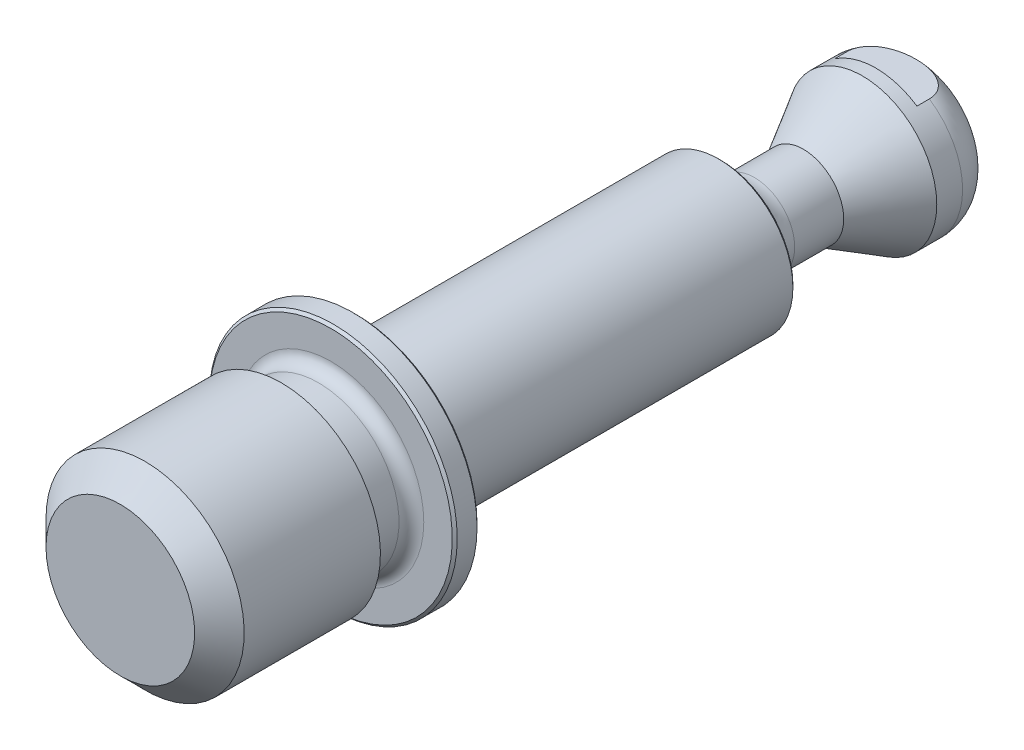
ISO-10303-21;
HEADER;
FILE_DESCRIPTION(('STEP AP214'),'2;1');
FILE_NAME('part.step','',(''),(''),'','','');
FILE_SCHEMA(('AUTOMOTIVE_DESIGN { 1 0 10303 214 1 1 1 1 }'));
ENDSEC;
DATA;
#1=APPLICATION_CONTEXT('core data for automotive mechanical design processes');
#2=APPLICATION_PROTOCOL_DEFINITION('international standard','automotive_design',2000,#1);
#3=PRODUCT_CONTEXT('',#1,'mechanical');
#4=PRODUCT('Part','Part','',(#3));
#5=PRODUCT_RELATED_PRODUCT_CATEGORY('part','',(#4));
#6=PRODUCT_DEFINITION_FORMATION('','',#4);
#7=PRODUCT_DEFINITION_CONTEXT('part definition',#1,'design');
#8=PRODUCT_DEFINITION('design','',#6,#7);
#9=PRODUCT_DEFINITION_SHAPE('','',#8);
#10=(LENGTH_UNIT() NAMED_UNIT(*) SI_UNIT(.MILLI.,.METRE.));
#11=(NAMED_UNIT(*) PLANE_ANGLE_UNIT() SI_UNIT($,.RADIAN.));
#12=(NAMED_UNIT(*) SI_UNIT($,.STERADIAN.) SOLID_ANGLE_UNIT());
#13=UNCERTAINTY_MEASURE_WITH_UNIT(LENGTH_MEASURE(1.E-05),#10,'distance_accuracy_value','');
#14=(GEOMETRIC_REPRESENTATION_CONTEXT(3) GLOBAL_UNCERTAINTY_ASSIGNED_CONTEXT((#13)) GLOBAL_UNIT_ASSIGNED_CONTEXT((#10,
#11,#12)) REPRESENTATION_CONTEXT('',''));
#15=CARTESIAN_POINT('',(0.,0.,0.));
#16=DIRECTION('',(0.,0.,1.));
#17=DIRECTION('',(1.,0.,0.));
#18=AXIS2_PLACEMENT_3D('',#15,#16,#17);
#19=CARTESIAN_POINT('',(0.,0.,0.));
#20=DIRECTION('',(0.,0.,1.));
#21=DIRECTION('',(-1.,0.,0.));
#22=AXIS2_PLACEMENT_3D('',#19,#20,#21);
#23=PLANE('',#22);
#24=CARTESIAN_POINT('',(0.,0.,0.));
#25=DIRECTION('',(0.,0.,1.));
#26=DIRECTION('',(-1.,0.,0.));
#27=AXIS2_PLACEMENT_3D('',#24,#25,#26);
#28=CIRCLE('',#27,9.8);
#29=CARTESIAN_POINT('',(-9.8,0.,0.));
#30=VERTEX_POINT('',#29);
#31=EDGE_CURVE('E157',#30,#30,#28,.T.);
#32=ORIENTED_EDGE('',*,*,#31,.T.);
#33=EDGE_LOOP('',(#32));
#34=FACE_BOUND('',#33,.T.);
#35=CARTESIAN_POINT('',(0.,0.,0.));
#36=DIRECTION('',(0.,0.,1.));
#37=DIRECTION('',(-1.,0.,0.));
#38=AXIS2_PLACEMENT_3D('',#35,#36,#37);
#39=CIRCLE('',#38,7.5);
#40=CARTESIAN_POINT('',(-7.5,0.,0.));
#41=VERTEX_POINT('',#40);
#42=EDGE_CURVE('E137',#41,#41,#39,.F.);
#43=ORIENTED_EDGE('',*,*,#42,.T.);
#44=EDGE_LOOP('',(#43));
#45=FACE_BOUND('',#44,.T.);
#46=ADVANCED_FACE('F15',(#34,#45),#23,.T.);
#47=CARTESIAN_POINT('',(0.,0.,0.));
#48=DIRECTION('',(0.,0.,-1.));
#49=DIRECTION('',(1.,0.,0.));
#50=AXIS2_PLACEMENT_3D('',#47,#48,#49);
#51=CYLINDRICAL_SURFACE('',#50,10.);
#52=CARTESIAN_POINT('',(0.,0.,-0.199999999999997));
#53=DIRECTION('',(0.,0.,1.));
#54=DIRECTION('',(-1.,0.,0.));
#55=AXIS2_PLACEMENT_3D('',#52,#53,#54);
#56=CIRCLE('',#55,10.);
#57=CARTESIAN_POINT('',(-10.,0.,-0.199999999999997));
#58=VERTEX_POINT('',#57);
#59=EDGE_CURVE('E153',#58,#58,#56,.F.);
#60=ORIENTED_EDGE('',*,*,#59,.T.);
#61=EDGE_LOOP('',(#60));
#62=FACE_BOUND('',#61,.T.);
#63=CARTESIAN_POINT('',(0.,0.,-1.8));
#64=DIRECTION('',(0.,0.,-1.));
#65=DIRECTION('',(1.,0.,0.));
#66=AXIS2_PLACEMENT_3D('',#63,#64,#65);
#67=CIRCLE('',#66,10.);
#68=CARTESIAN_POINT('',(10.,0.,-1.8));
#69=VERTEX_POINT('',#68);
#70=EDGE_CURVE('E149',#69,#69,#67,.F.);
#71=ORIENTED_EDGE('',*,*,#70,.T.);
#72=EDGE_LOOP('',(#71));
#73=FACE_BOUND('',#72,.T.);
#74=ADVANCED_FACE('F225',(#62,#73),#51,.T.);
#75=CARTESIAN_POINT('',(10.,0.,-2.));
#76=DIRECTION('',(0.,0.,-1.));
#77=DIRECTION('',(1.,0.,0.));
#78=AXIS2_PLACEMENT_3D('',#75,#76,#77);
#79=PLANE('',#78);
#80=CARTESIAN_POINT('',(0.,0.,-2.));
#81=DIRECTION('',(0.,0.,-1.));
#82=DIRECTION('',(1.,0.,0.));
#83=AXIS2_PLACEMENT_3D('',#80,#81,#82);
#84=CIRCLE('',#83,9.8);
#85=CARTESIAN_POINT('',(9.8,0.,-2.));
#86=VERTEX_POINT('',#85);
#87=EDGE_CURVE('E161',#86,#86,#84,.T.);
#88=ORIENTED_EDGE('',*,*,#87,.T.);
#89=EDGE_LOOP('',(#88));
#90=FACE_BOUND('',#89,.T.);
#91=CARTESIAN_POINT('',(0.,0.,-2.));
#92=DIRECTION('',(0.,0.,-1.));
#93=DIRECTION('',(1.,0.,0.));
#94=AXIS2_PLACEMENT_3D('',#91,#92,#93);
#95=CIRCLE('',#94,6.4);
#96=CARTESIAN_POINT('',(6.4,0.,-2.));
#97=VERTEX_POINT('',#96);
#98=EDGE_CURVE('E145',#97,#97,#95,.F.);
#99=ORIENTED_EDGE('',*,*,#98,.T.);
#100=EDGE_LOOP('',(#99));
#101=FACE_BOUND('',#100,.T.);
#102=ADVANCED_FACE('F221',(#90,#101),#79,.T.);
#103=CARTESIAN_POINT('',(0.,0.,0.));
#104=DIRECTION('',(0.,0.,-1.));
#105=DIRECTION('',(1.,0.,0.));
#106=AXIS2_PLACEMENT_3D('',#103,#104,#105);
#107=CYLINDRICAL_SURFACE('',#106,6.);
#108=CARTESIAN_POINT('',(0.,0.,-2.4));
#109=DIRECTION('',(0.,0.,-1.));
#110=DIRECTION('',(1.,0.,0.));
#111=AXIS2_PLACEMENT_3D('',#108,#109,#110);
#112=CIRCLE('',#111,6.);
#113=CARTESIAN_POINT('',(6.,0.,-2.4));
#114=VERTEX_POINT('',#113);
#115=EDGE_CURVE('E141',#114,#114,#112,.T.);
#116=ORIENTED_EDGE('',*,*,#115,.T.);
#117=EDGE_LOOP('',(#116));
#118=FACE_BOUND('',#117,.T.);
#119=CARTESIAN_POINT('',(0.,0.,-31.3));
#120=DIRECTION('',(0.,0.,-1.));
#121=DIRECTION('',(1.,0.,0.));
#122=AXIS2_PLACEMENT_3D('',#119,#120,#121);
#123=CIRCLE('',#122,6.);
#124=CARTESIAN_POINT('',(6.,0.,-31.3));
#125=VERTEX_POINT('',#124);
#126=EDGE_CURVE('E106',#125,#125,#123,.F.);
#127=ORIENTED_EDGE('',*,*,#126,.T.);
#128=EDGE_LOOP('',(#127));
#129=FACE_BOUND('',#128,.T.);
#130=ADVANCED_FACE('F217',(#118,#129),#107,.T.);
#131=CARTESIAN_POINT('',(0.,0.,0.));
#132=DIRECTION('',(0.,0.,-1.));
#133=DIRECTION('',(1.,0.,0.));
#134=AXIS2_PLACEMENT_3D('',#131,#132,#133);
#135=CYLINDRICAL_SURFACE('',#134,3.25);
#136=CARTESIAN_POINT('',(0.,0.,-34.1958301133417));
#137=DIRECTION('',(0.,0.,1.));
#138=DIRECTION('',(-1.,0.,0.));
#139=AXIS2_PLACEMENT_3D('',#136,#137,#138);
#140=CIRCLE('',#139,3.25);
#141=CARTESIAN_POINT('',(-3.25,0.,-34.1958301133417));
#142=VERTEX_POINT('',#141);
#143=EDGE_CURVE('E110',#142,#142,#140,.F.);
#144=ORIENTED_EDGE('',*,*,#143,.T.);
#145=EDGE_LOOP('',(#144));
#146=FACE_BOUND('',#145,.T.);
#147=CARTESIAN_POINT('',(0.,0.,-38.15));
#148=DIRECTION('',(0.,0.,-1.));
#149=DIRECTION('',(1.,0.,0.));
#150=AXIS2_PLACEMENT_3D('',#147,#148,#149);
#151=CIRCLE('',#150,3.25);
#152=CARTESIAN_POINT('',(3.25,0.,-38.15));
#153=VERTEX_POINT('',#152);
#154=EDGE_CURVE('E92',#153,#153,#151,.T.);
#155=ORIENTED_EDGE('',*,*,#154,.F.);
#156=EDGE_LOOP('',(#155));
#157=FACE_BOUND('',#156,.T.);
#158=ADVANCED_FACE('F213',(#146,#157),#135,.T.);
#159=CARTESIAN_POINT('',(0.,0.,-42.9131397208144));
#160=DIRECTION('',(0.,0.,-1.));
#161=DIRECTION('',(1.,0.,0.));
#162=AXIS2_PLACEMENT_3D('',#159,#160,#161);
#163=CONICAL_SURFACE('',#162,6.,0.523598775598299);
#164=ORIENTED_EDGE('',*,*,#154,.T.);
#165=EDGE_LOOP('',(#164));
#166=FACE_BOUND('',#165,.T.);
#167=CARTESIAN_POINT('',(0.,0.,-42.9131397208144));
#168=DIRECTION('',(0.,0.,-1.));
#169=DIRECTION('',(1.,0.,0.));
#170=AXIS2_PLACEMENT_3D('',#167,#168,#169);
#171=CIRCLE('',#170,6.);
#172=CARTESIAN_POINT('',(6.,0.,-42.9131397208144));
#173=VERTEX_POINT('',#172);
#174=EDGE_CURVE('E88',#173,#173,#171,.T.);
#175=ORIENTED_EDGE('',*,*,#174,.F.);
#176=EDGE_LOOP('',(#175));
#177=FACE_BOUND('',#176,.T.);
#178=ADVANCED_FACE('F210',(#166,#177),#163,.T.);
#179=CARTESIAN_POINT('',(0.,0.,0.));
#180=DIRECTION('',(0.,0.,-1.));
#181=DIRECTION('',(1.,0.,0.));
#182=AXIS2_PLACEMENT_3D('',#179,#180,#181);
#183=CYLINDRICAL_SURFACE('',#182,6.);
#184=DIRECTION('',(0.,0.,-1.));
#185=VECTOR('',#184,1.);
#186=CARTESIAN_POINT('',(3.31662479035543,-5.,0.));
#187=LINE('',#186,#185);
#188=CARTESIAN_POINT('',(3.31662479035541,-5.,-45.));
#189=VERTEX_POINT('',#188);
#190=CARTESIAN_POINT('',(3.31662479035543,-5.,-44.));
#191=VERTEX_POINT('',#190);
#192=EDGE_CURVE('E62',#189,#191,#187,.F.);
#193=ORIENTED_EDGE('',*,*,#192,.F.);
#194=CARTESIAN_POINT('',(0.,0.,-45.));
#195=DIRECTION('',(0.,0.,-1.));
#196=DIRECTION('',(1.,0.,0.));
#197=AXIS2_PLACEMENT_3D('',#194,#195,#196);
#198=CIRCLE('',#197,6.);
#199=CARTESIAN_POINT('',(3.31662479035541,5.,-45.));
#200=VERTEX_POINT('',#199);
#201=EDGE_CURVE('E39',#189,#200,#198,.F.);
#202=ORIENTED_EDGE('',*,*,#201,.T.);
#203=DIRECTION('',(0.,0.,-1.));
#204=VECTOR('',#203,1.);
#205=CARTESIAN_POINT('',(3.31662479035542,5.,0.));
#206=LINE('',#205,#204);
#207=CARTESIAN_POINT('',(3.31662479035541,5.,-44.));
#208=VERTEX_POINT('',#207);
#209=EDGE_CURVE('E81',#208,#200,#206,.T.);
#210=ORIENTED_EDGE('',*,*,#209,.F.);
#211=CARTESIAN_POINT('',(0.,0.,-44.));
#212=DIRECTION('',(0.,0.,1.));
#213=DIRECTION('',(0.,-1.,0.));
#214=AXIS2_PLACEMENT_3D('',#211,#212,#213);
#215=CIRCLE('',#214,6.);
#216=CARTESIAN_POINT('',(-3.31662479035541,5.,-44.));
#217=VERTEX_POINT('',#216);
#218=EDGE_CURVE('E173',#217,#208,#215,.F.);
#219=ORIENTED_EDGE('',*,*,#218,.F.);
#220=DIRECTION('',(0.,0.,-1.));
#221=VECTOR('',#220,1.);
#222=CARTESIAN_POINT('',(-3.31662479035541,5.,0.));
#223=LINE('',#222,#221);
#224=CARTESIAN_POINT('',(-3.31662479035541,5.,-45.));
#225=VERTEX_POINT('',#224);
#226=EDGE_CURVE('E84',#225,#217,#223,.F.);
#227=ORIENTED_EDGE('',*,*,#226,.F.);
#228=CARTESIAN_POINT('',(-3.31662479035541,-5.,-45.));
#229=VERTEX_POINT('',#228);
#230=EDGE_CURVE('E70',#225,#229,#198,.F.);
#231=ORIENTED_EDGE('',*,*,#230,.T.);
#232=DIRECTION('',(0.,0.,-1.));
#233=VECTOR('',#232,1.);
#234=CARTESIAN_POINT('',(-3.31662479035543,-5.,0.));
#235=LINE('',#234,#233);
#236=CARTESIAN_POINT('',(-3.31662479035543,-5.,-44.));
#237=VERTEX_POINT('',#236);
#238=EDGE_CURVE('E31',#237,#229,#235,.T.);
#239=ORIENTED_EDGE('',*,*,#238,.F.);
#240=CARTESIAN_POINT('',(0.,0.,-44.));
#241=DIRECTION('',(0.,0.,1.));
#242=DIRECTION('',(0.,-1.,0.));
#243=AXIS2_PLACEMENT_3D('',#240,#241,#242);
#244=CIRCLE('',#243,6.);
#245=EDGE_CURVE('E9',#191,#237,#244,.F.);
#246=ORIENTED_EDGE('',*,*,#245,.F.);
#247=EDGE_LOOP('',(#193,#202,#210,#219,#227,#231,#239,#246));
#248=FACE_BOUND('',#247,.T.);
#249=ORIENTED_EDGE('',*,*,#174,.T.);
#250=EDGE_LOOP('',(#249));
#251=FACE_BOUND('',#250,.T.);
#252=ADVANCED_FACE('F66',(#248,#251),#183,.T.);
#253=CARTESIAN_POINT('',(0.,0.,-48.));
#254=DIRECTION('',(0.,0.,-1.));
#255=DIRECTION('',(1.,0.,0.));
#256=AXIS2_PLACEMENT_3D('',#253,#254,#255);
#257=PLANE('',#256);
#258=CARTESIAN_POINT('',(0.,0.,-48.));
#259=DIRECTION('',(0.,0.,-1.));
#260=DIRECTION('',(1.,0.,0.));
#261=AXIS2_PLACEMENT_3D('',#258,#259,#260);
#262=CIRCLE('',#261,3.);
#263=CARTESIAN_POINT('',(3.,0.,-48.));
#264=VERTEX_POINT('',#263);
#265=EDGE_CURVE('E96',#264,#264,#262,.T.);
#266=ORIENTED_EDGE('',*,*,#265,.T.);
#267=EDGE_LOOP('',(#266));
#268=FACE_BOUND('',#267,.T.);
#269=ADVANCED_FACE('F204',(#268),#257,.T.);
#270=CARTESIAN_POINT('',(0.,0.,-45.));
#271=DIRECTION('',(0.,0.,-1.));
#272=DIRECTION('',(1.,0.,0.));
#273=AXIS2_PLACEMENT_3D('',#270,#271,#272);
#274=DEGENERATE_TOROIDAL_SURFACE('',#273,3.,3.,.T.);
#275=CARTESIAN_POINT('',(0.,-5.,-47.2360679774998));
#276=CARTESIAN_POINT('',(0.120918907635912,-5.,-47.2360654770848));
#277=CARTESIAN_POINT('',(0.241827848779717,-5.,-47.2321569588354));
#278=CARTESIAN_POINT('',(0.483117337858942,-5.,-47.2163673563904));
#279=CARTESIAN_POINT('',(0.603497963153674,-5.,-47.204487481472));
#280=CARTESIAN_POINT('',(0.843175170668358,-5.,-47.172309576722));
#281=CARTESIAN_POINT('',(0.962471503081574,-5.,-47.1520096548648));
#282=CARTESIAN_POINT('',(1.19911813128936,-5.,-47.1022831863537));
#283=CARTESIAN_POINT('',(1.31646901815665,-5.,-47.0728594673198));
#284=CARTESIAN_POINT('',(1.59010251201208,-5.,-46.9914925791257));
#285=CARTESIAN_POINT('',(1.74515200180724,-5.,-46.9352545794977));
#286=CARTESIAN_POINT('',(2.0457254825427,-5.,-46.8013699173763));
#287=CARTESIAN_POINT('',(2.19126336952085,-5.,-46.7237553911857));
#288=CARTESIAN_POINT('',(2.43890308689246,-5.,-46.5627711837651));
#289=CARTESIAN_POINT('',(2.54382254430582,-5.,-46.4837739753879));
#290=CARTESIAN_POINT('',(2.73962827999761,-5.,-46.3098769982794));
#291=CARTESIAN_POINT('',(2.83053188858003,-5.,-46.214997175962));
#292=CARTESIAN_POINT('',(2.97723052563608,-5.,-46.0301159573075));
#293=CARTESIAN_POINT('',(3.03641451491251,-5.,-45.942813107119));
#294=CARTESIAN_POINT('',(3.13957828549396,-5.,-45.7595839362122));
#295=CARTESIAN_POINT('',(3.18356514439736,-5.,-45.663661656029));
#296=CARTESIAN_POINT('',(3.25393965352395,-5.,-45.4648474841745));
#297=CARTESIAN_POINT('',(3.28022077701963,-5.,-45.3619174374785));
#298=CARTESIAN_POINT('',(3.31290834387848,-5.,-45.1529411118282));
#299=CARTESIAN_POINT('',(3.31932342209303,-5.,-45.0468962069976));
#300=CARTESIAN_POINT('',(3.31222176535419,-5.,-44.8462659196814));
#301=CARTESIAN_POINT('',(3.30065386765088,-5.,-44.7516055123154));
#302=CARTESIAN_POINT('',(3.26181910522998,-5.,-44.5655953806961));
#303=CARTESIAN_POINT('',(3.23455371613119,-5.,-44.4742453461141));
#304=CARTESIAN_POINT('',(3.16568011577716,-5.,-44.2967666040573));
#305=CARTESIAN_POINT('',(3.12401645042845,-5.,-44.2106596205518));
#306=CARTESIAN_POINT('',(3.02836892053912,-5.,-44.0456244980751));
#307=CARTESIAN_POINT('',(2.97437928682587,-5.,-43.9666997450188));
#308=CARTESIAN_POINT('',(2.83319578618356,-5.,-43.7878200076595));
#309=CARTESIAN_POINT('',(2.74125094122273,-5.,-43.6916074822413));
#310=CARTESIAN_POINT('',(2.54296994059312,-5.,-43.5154254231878));
#311=CARTESIAN_POINT('',(2.43660860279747,-5.,-43.4354849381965));
#312=CARTESIAN_POINT('',(2.16830650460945,-5.,-43.2616870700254));
#313=CARTESIAN_POINT('',(2.0014223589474,-5.,-43.1755042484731));
#314=CARTESIAN_POINT('',(1.65626349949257,-5.,-43.0302057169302));
#315=CARTESIAN_POINT('',(1.47796334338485,-5.,-42.9711530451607));
#316=CARTESIAN_POINT('',(1.15914275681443,-5.,-42.8876929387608));
#317=CARTESIAN_POINT('',(1.01985771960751,-5.,-42.8583678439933));
#318=CARTESIAN_POINT('',(0.739223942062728,-5.,-42.8117236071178));
#319=CARTESIAN_POINT('',(0.597874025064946,-5.,-42.7944116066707));
#320=CARTESIAN_POINT('',(0.314037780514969,-5.,-42.7709143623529));
#321=CARTESIAN_POINT('',(0.171549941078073,-5.,-42.7647478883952));
#322=CARTESIAN_POINT('',(-0.113440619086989,-5.,-42.7632671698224));
#323=CARTESIAN_POINT('',(-0.25594331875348,-5.,-42.7679492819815));
#324=CARTESIAN_POINT('',(-0.518018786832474,-5.,-42.7868218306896));
#325=CARTESIAN_POINT('',(-0.637707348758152,-5.,-42.7994184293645));
#326=CARTESIAN_POINT('',(-0.875936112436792,-5.,-42.8330000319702));
#327=CARTESIAN_POINT('',(-0.994476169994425,-5.,-42.8539860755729));
#328=CARTESIAN_POINT('',(-1.22924960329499,-5.,-42.9049977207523));
#329=CARTESIAN_POINT('',(-1.34548886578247,-5.,-42.9349958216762));
#330=CARTESIAN_POINT('',(-1.57487815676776,-5.,-43.0049676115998));
#331=CARTESIAN_POINT('',(-1.68802992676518,-5.,-43.0449355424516));
#332=CARTESIAN_POINT('',(-1.93726711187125,-5.,-43.1471729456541));
#333=CARTESIAN_POINT('',(-2.07212579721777,-5.,-43.2125115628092));
#334=CARTESIAN_POINT('',(-2.3307739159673,-5.,-43.3624490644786));
#335=CARTESIAN_POINT('',(-2.45457463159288,-5.,-43.4470279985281));
#336=CARTESIAN_POINT('',(-2.66253632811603,-5.,-43.6179675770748));
#337=CARTESIAN_POINT('',(-2.7496924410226,-5.,-43.7006594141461));
#338=CARTESIAN_POINT('',(-2.909419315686,-5.,-43.8791550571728));
#339=CARTESIAN_POINT('',(-2.98200679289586,-5.,-43.9749436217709));
#340=CARTESIAN_POINT('',(-3.09823540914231,-5.,-44.1618145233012));
#341=CARTESIAN_POINT('',(-3.14465751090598,-5.,-44.2511615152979));
#342=CARTESIAN_POINT('',(-3.2219588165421,-5.,-44.4363821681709));
#343=CARTESIAN_POINT('',(-3.25284467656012,-5.,-44.5322530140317));
#344=CARTESIAN_POINT('',(-3.29731276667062,-5.,-44.7283734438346));
#345=CARTESIAN_POINT('',(-3.31082509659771,-5.,-44.8286390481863));
#346=CARTESIAN_POINT('',(-3.31940920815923,-5.,-45.0299567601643));
#347=CARTESIAN_POINT('',(-3.31448404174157,-5.,-45.1310087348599));
#348=CARTESIAN_POINT('',(-3.28751634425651,-5.,-45.3236265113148));
#349=CARTESIAN_POINT('',(-3.26668052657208,-5.,-45.4153652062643));
#350=CARTESIAN_POINT('',(-3.21051142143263,-5.,-45.5942547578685));
#351=CARTESIAN_POINT('',(-3.17517729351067,-5.,-45.6814053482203));
#352=CARTESIAN_POINT('',(-3.08996682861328,-5.,-45.8529027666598));
#353=CARTESIAN_POINT('',(-3.0395342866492,-5.,-45.936971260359));
#354=CARTESIAN_POINT('',(-2.92708168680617,-5.,-46.0969044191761));
#355=CARTESIAN_POINT('',(-2.86505640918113,-5.,-46.1727653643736));
#356=CARTESIAN_POINT('',(-2.70091379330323,-5.,-46.3486262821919));
#357=CARTESIAN_POINT('',(-2.59347912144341,-5.,-46.4436767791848));
#358=CARTESIAN_POINT('',(-2.3646875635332,-5.,-46.6152304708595));
#359=CARTESIAN_POINT('',(-2.2432978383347,-5.,-46.6916885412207));
#360=CARTESIAN_POINT('',(-1.93419060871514,-5.,-46.8581380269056));
#361=CARTESIAN_POINT('',(-1.74132926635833,-5.,-46.9385798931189));
#362=CARTESIAN_POINT('',(-1.44490972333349,-5.,-47.0360436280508));
#363=CARTESIAN_POINT('',(-1.3448228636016,-5.,-47.0646801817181));
#364=CARTESIAN_POINT('',(-1.14288449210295,-5.,-47.1148876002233));
#365=CARTESIAN_POINT('',(-1.04103334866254,-5.,-47.1364599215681));
#366=CARTESIAN_POINT('',(-0.783859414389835,-5.,-47.1824311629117));
#367=CARTESIAN_POINT('',(-0.627789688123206,-5.,-47.2026484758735));
#368=CARTESIAN_POINT('',(-0.314474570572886,-5.,-47.2294704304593));
#369=CARTESIAN_POINT('',(-0.157228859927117,-5.,-47.2360712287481));
#370=CARTESIAN_POINT('',(0.,-5.,-47.2360679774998));
#371=B_SPLINE_CURVE_WITH_KNOTS('',3,(#275,#276,#277,#278,#279,#280,#281,#282,#283,#284,#285,
#286,#287,#288,#289,#290,#291,#292,#293,#294,#295,#296,#297,#298,#299,#300,#301,#302,#303,#304,
#305,#306,#307,#308,#309,#310,#311,#312,#313,#314,#315,#316,#317,#318,#319,#320,#321,#322,#323,
#324,#325,#326,#327,#328,#329,#330,#331,#332,#333,#334,#335,#336,#337,#338,#339,#340,#341,#342,
#343,#344,#345,#346,#347,#348,#349,#350,#351,#352,#353,#354,#355,#356,#357,#358,#359,#360,#361,
#362,#363,#364,#365,#366,#367,#368,#369,#370),.UNSPECIFIED.,.T.,.F.,(4,2,2,2,2,2,2,2,2,2,2,2,2,
2,2,2,2,2,2,2,2,2,2,2,2,2,2,2,2,2,2,2,2,2,2,2,2,2,2,2,2,2,2,2,2,2,2,4),(0.,0.362673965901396,
0.725292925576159,1.08799341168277,1.45058160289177,1.94401806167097,2.43671672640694,
2.8293214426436,3.22143674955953,3.5365784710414,3.85157322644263,4.16844661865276,
4.48518226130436,4.76990781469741,5.05460660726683,5.34041435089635,5.62635614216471,
6.02338925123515,6.4211250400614,6.98148877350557,7.54314803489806,7.96962891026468,
8.39636310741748,8.82381529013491,9.25112394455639,9.611905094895,9.97273096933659,
10.3324667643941,10.6919952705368,11.1401969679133,11.5879360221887,11.9470202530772,
12.3056901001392,12.6064755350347,12.9071319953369,13.2089943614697,13.5108067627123,
13.791757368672,14.072724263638,14.3656805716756,14.6587691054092,15.0866864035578,
15.5156321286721,16.1388153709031,16.4509640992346,16.7630484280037,17.2344943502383,
17.7060733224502),.UNSPECIFIED.);
#372=EDGE_CURVE('E24',#229,#189,#371,.T.);
#373=ORIENTED_EDGE('',*,*,#372,.F.);
#374=ORIENTED_EDGE('',*,*,#230,.F.);
#375=CARTESIAN_POINT('',(0.,5.,-47.2360679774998));
#376=CARTESIAN_POINT('',(-0.120918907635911,5.,-47.2360654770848));
#377=CARTESIAN_POINT('',(-0.241827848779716,5.,-47.2321569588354));
#378=CARTESIAN_POINT('',(-0.483117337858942,5.,-47.2163673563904));
#379=CARTESIAN_POINT('',(-0.603497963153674,5.,-47.204487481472));
#380=CARTESIAN_POINT('',(-0.843175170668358,5.,-47.172309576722));
#381=CARTESIAN_POINT('',(-0.962471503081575,5.,-47.1520096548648));
#382=CARTESIAN_POINT('',(-1.19911813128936,5.,-47.1022831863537));
#383=CARTESIAN_POINT('',(-1.31646901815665,5.,-47.0728594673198));
#384=CARTESIAN_POINT('',(-1.59010251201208,5.,-46.9914925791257));
#385=CARTESIAN_POINT('',(-1.74515200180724,5.,-46.9352545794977));
#386=CARTESIAN_POINT('',(-2.0457254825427,5.,-46.8013699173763));
#387=CARTESIAN_POINT('',(-2.19126336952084,5.,-46.7237553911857));
#388=CARTESIAN_POINT('',(-2.43890308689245,5.,-46.5627711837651));
#389=CARTESIAN_POINT('',(-2.54382254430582,5.,-46.4837739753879));
#390=CARTESIAN_POINT('',(-2.7396282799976,5.,-46.3098769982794));
#391=CARTESIAN_POINT('',(-2.83053188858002,5.,-46.214997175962));
#392=CARTESIAN_POINT('',(-2.97723052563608,5.,-46.0301159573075));
#393=CARTESIAN_POINT('',(-3.0364145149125,5.,-45.942813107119));
#394=CARTESIAN_POINT('',(-3.13957828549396,5.,-45.7595839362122));
#395=CARTESIAN_POINT('',(-3.18356514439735,5.,-45.663661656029));
#396=CARTESIAN_POINT('',(-3.25393965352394,5.,-45.4648474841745));
#397=CARTESIAN_POINT('',(-3.28022077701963,5.,-45.3619174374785));
#398=CARTESIAN_POINT('',(-3.31290834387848,5.,-45.1529411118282));
#399=CARTESIAN_POINT('',(-3.31932342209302,5.,-45.0468962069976));
#400=CARTESIAN_POINT('',(-3.31222176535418,5.,-44.8462659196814));
#401=CARTESIAN_POINT('',(-3.30065386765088,5.,-44.7516055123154));
#402=CARTESIAN_POINT('',(-3.26181910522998,5.,-44.5655953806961));
#403=CARTESIAN_POINT('',(-3.23455371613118,5.,-44.4742453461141));
#404=CARTESIAN_POINT('',(-3.16568011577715,5.,-44.2967666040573));
#405=CARTESIAN_POINT('',(-3.12401645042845,5.,-44.2106596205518));
#406=CARTESIAN_POINT('',(-3.02836892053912,5.,-44.0456244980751));
#407=CARTESIAN_POINT('',(-2.97437928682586,5.,-43.9666997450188));
#408=CARTESIAN_POINT('',(-2.83319578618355,5.,-43.7878200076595));
#409=CARTESIAN_POINT('',(-2.74125094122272,5.,-43.6916074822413));
#410=CARTESIAN_POINT('',(-2.54296994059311,5.,-43.5154254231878));
#411=CARTESIAN_POINT('',(-2.43660860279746,5.,-43.4354849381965));
#412=CARTESIAN_POINT('',(-2.16830650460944,5.,-43.2616870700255));
#413=CARTESIAN_POINT('',(-2.00142235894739,5.,-43.1755042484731));
#414=CARTESIAN_POINT('',(-1.65626349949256,5.,-43.0302057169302));
#415=CARTESIAN_POINT('',(-1.47796334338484,5.,-42.9711530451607));
#416=CARTESIAN_POINT('',(-1.15914275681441,5.,-42.8876929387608));
#417=CARTESIAN_POINT('',(-1.01985771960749,5.,-42.8583678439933));
#418=CARTESIAN_POINT('',(-0.739223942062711,5.,-42.8117236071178));
#419=CARTESIAN_POINT('',(-0.597874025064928,5.,-42.7944116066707));
#420=CARTESIAN_POINT('',(-0.314037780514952,5.,-42.7709143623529));
#421=CARTESIAN_POINT('',(-0.171549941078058,5.,-42.7647478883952));
#422=CARTESIAN_POINT('',(0.113440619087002,5.,-42.7632671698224));
#423=CARTESIAN_POINT('',(0.255943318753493,5.,-42.7679492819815));
#424=CARTESIAN_POINT('',(0.518018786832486,5.,-42.7868218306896));
#425=CARTESIAN_POINT('',(0.637707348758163,5.,-42.7994184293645));
#426=CARTESIAN_POINT('',(0.8759361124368,5.,-42.8330000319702));
#427=CARTESIAN_POINT('',(0.99447616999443,5.,-42.8539860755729));
#428=CARTESIAN_POINT('',(1.229249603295,5.,-42.9049977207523));
#429=CARTESIAN_POINT('',(1.34548886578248,5.,-42.9349958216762));
#430=CARTESIAN_POINT('',(1.57487815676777,5.,-43.0049676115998));
#431=CARTESIAN_POINT('',(1.68802992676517,5.,-43.0449355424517));
#432=CARTESIAN_POINT('',(1.93726711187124,5.,-43.1471729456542));
#433=CARTESIAN_POINT('',(2.07212579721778,5.,-43.2125115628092));
#434=CARTESIAN_POINT('',(2.33077391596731,5.,-43.3624490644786));
#435=CARTESIAN_POINT('',(2.45457463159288,5.,-43.4470279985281));
#436=CARTESIAN_POINT('',(2.66253632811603,5.,-43.6179675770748));
#437=CARTESIAN_POINT('',(2.74969244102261,5.,-43.7006594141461));
#438=CARTESIAN_POINT('',(2.909419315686,5.,-43.8791550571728));
#439=CARTESIAN_POINT('',(2.98200679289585,5.,-43.9749436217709));
#440=CARTESIAN_POINT('',(3.0982354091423,5.,-44.1618145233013));
#441=CARTESIAN_POINT('',(3.14465751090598,5.,-44.2511615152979));
#442=CARTESIAN_POINT('',(3.22195881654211,5.,-44.4363821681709));
#443=CARTESIAN_POINT('',(3.25284467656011,5.,-44.5322530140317));
#444=CARTESIAN_POINT('',(3.29731276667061,5.,-44.7283734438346));
#445=CARTESIAN_POINT('',(3.31082509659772,5.,-44.8286390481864));
#446=CARTESIAN_POINT('',(3.31940920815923,5.,-45.0299567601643));
#447=CARTESIAN_POINT('',(3.31448404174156,5.,-45.1310087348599));
#448=CARTESIAN_POINT('',(3.2875163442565,5.,-45.3236265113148));
#449=CARTESIAN_POINT('',(3.26668052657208,5.,-45.4153652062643));
#450=CARTESIAN_POINT('',(3.21051142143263,5.,-45.5942547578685));
#451=CARTESIAN_POINT('',(3.17517729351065,5.,-45.6814053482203));
#452=CARTESIAN_POINT('',(3.08996682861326,5.,-45.8529027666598));
#453=CARTESIAN_POINT('',(3.03953428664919,5.,-45.936971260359));
#454=CARTESIAN_POINT('',(2.92708168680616,5.,-46.0969044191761));
#455=CARTESIAN_POINT('',(2.86505640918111,5.,-46.1727653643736));
#456=CARTESIAN_POINT('',(2.7009137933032,5.,-46.3486262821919));
#457=CARTESIAN_POINT('',(2.59347912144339,5.,-46.4436767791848));
#458=CARTESIAN_POINT('',(2.36468756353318,5.,-46.6152304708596));
#459=CARTESIAN_POINT('',(2.24329783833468,5.,-46.6916885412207));
#460=CARTESIAN_POINT('',(1.9341906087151,5.,-46.8581380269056));
#461=CARTESIAN_POINT('',(1.74132926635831,5.,-46.9385798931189));
#462=CARTESIAN_POINT('',(1.44490972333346,5.,-47.0360436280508));
#463=CARTESIAN_POINT('',(1.34482286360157,5.,-47.0646801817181));
#464=CARTESIAN_POINT('',(1.14288449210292,5.,-47.1148876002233));
#465=CARTESIAN_POINT('',(1.04103334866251,5.,-47.1364599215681));
#466=CARTESIAN_POINT('',(0.78385941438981,5.,-47.1824311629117));
#467=CARTESIAN_POINT('',(0.627789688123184,5.,-47.2026484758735));
#468=CARTESIAN_POINT('',(0.314474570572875,5.,-47.2294704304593));
#469=CARTESIAN_POINT('',(0.157228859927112,5.,-47.2360712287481));
#470=CARTESIAN_POINT('',(0.,5.,-47.2360679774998));
#471=B_SPLINE_CURVE_WITH_KNOTS('',3,(#375,#376,#377,#378,#379,#380,#381,#382,#383,#384,#385,
#386,#387,#388,#389,#390,#391,#392,#393,#394,#395,#396,#397,#398,#399,#400,#401,#402,#403,#404,
#405,#406,#407,#408,#409,#410,#411,#412,#413,#414,#415,#416,#417,#418,#419,#420,#421,#422,#423,
#424,#425,#426,#427,#428,#429,#430,#431,#432,#433,#434,#435,#436,#437,#438,#439,#440,#441,#442,
#443,#444,#445,#446,#447,#448,#449,#450,#451,#452,#453,#454,#455,#456,#457,#458,#459,#460,#461,
#462,#463,#464,#465,#466,#467,#468,#469,#470),.UNSPECIFIED.,.T.,.F.,(4,2,2,2,2,2,2,2,2,2,2,2,2,
2,2,2,2,2,2,2,2,2,2,2,2,2,2,2,2,2,2,2,2,2,2,2,2,2,2,2,2,2,2,2,2,2,2,4),(0.,0.362673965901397,
0.725292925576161,1.08799341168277,1.45058160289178,1.94401806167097,2.43671672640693,
2.8293214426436,3.22143674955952,3.53657847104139,3.85157322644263,4.16844661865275,
4.48518226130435,4.76990781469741,5.05460660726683,5.34041435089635,5.6263561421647,
6.02338925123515,6.42112504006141,6.98148877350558,7.54314803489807,7.96962891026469,
8.39636310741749,8.82381529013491,9.2511239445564,9.61190509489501,9.97273096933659,
10.3324667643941,10.6919952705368,11.1401969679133,11.5879360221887,11.9470202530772,
12.3056901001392,12.6064755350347,12.9071319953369,13.2089943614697,13.5108067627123,
13.791757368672,14.072724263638,14.3656805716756,14.6587691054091,15.0866864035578,
15.5156321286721,16.1388153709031,16.4509640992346,16.7630484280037,17.2344943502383,
17.7060733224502),.UNSPECIFIED.);
#472=EDGE_CURVE('E165',#200,#225,#471,.T.);
#473=ORIENTED_EDGE('',*,*,#472,.F.);
#474=ORIENTED_EDGE('',*,*,#201,.F.);
#475=EDGE_LOOP('',(#373,#374,#473,#474));
#476=FACE_BOUND('',#475,.T.);
#477=ORIENTED_EDGE('',*,*,#265,.F.);
#478=EDGE_LOOP('',(#477));
#479=FACE_BOUND('',#478,.T.);
#480=ADVANCED_FACE('F174',(#476,#479),#274,.T.);
#481=CARTESIAN_POINT('',(0.,0.,-31.5));
#482=DIRECTION('',(0.,0.,1.));
#483=DIRECTION('',(-1.,0.,0.));
#484=AXIS2_PLACEMENT_3D('',#481,#482,#483);
#485=CONICAL_SURFACE('',#484,5.8,0.785398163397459);
#486=ORIENTED_EDGE('',*,*,#126,.F.);
#487=EDGE_LOOP('',(#486));
#488=FACE_BOUND('',#487,.T.);
#489=CARTESIAN_POINT('',(0.,0.,-31.5));
#490=DIRECTION('',(0.,0.,-1.));
#491=DIRECTION('',(1.,0.,0.));
#492=AXIS2_PLACEMENT_3D('',#489,#490,#491);
#493=CIRCLE('',#492,5.8);
#494=CARTESIAN_POINT('',(5.8,0.,-31.5));
#495=VERTEX_POINT('',#494);
#496=EDGE_CURVE('E102',#495,#495,#493,.T.);
#497=ORIENTED_EDGE('',*,*,#496,.F.);
#498=EDGE_LOOP('',(#497));
#499=FACE_BOUND('',#498,.T.);
#500=ADVANCED_FACE('F275',(#488,#499),#485,.T.);
#501=CARTESIAN_POINT('',(0.,0.,-34.1958301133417));
#502=DIRECTION('',(0.,0.,1.));
#503=DIRECTION('',(-1.,0.,0.));
#504=AXIS2_PLACEMENT_3D('',#501,#502,#503);
#505=TOROIDAL_SURFACE('',#504,5.95,2.7);
#506=ORIENTED_EDGE('',*,*,#496,.T.);
#507=EDGE_LOOP('',(#506));
#508=FACE_BOUND('',#507,.T.);
#509=ORIENTED_EDGE('',*,*,#143,.F.);
#510=EDGE_LOOP('',(#509));
#511=FACE_BOUND('',#510,.T.);
#512=ADVANCED_FACE('F194',(#508,#511),#505,.F.);
#513=CARTESIAN_POINT('',(6.5,0.,4.));
#514=DIRECTION('',(0.,0.,-1.));
#515=DIRECTION('',(0.,1.,0.));
#516=AXIS2_PLACEMENT_3D('',#513,#514,#515);
#517=PLANE('',#516);
#518=CARTESIAN_POINT('',(0.,0.,4.));
#519=DIRECTION('',(0.,0.,-1.));
#520=DIRECTION('',(0.,1.,0.));
#521=AXIS2_PLACEMENT_3D('',#518,#519,#520);
#522=CIRCLE('',#521,7.5);
#523=CARTESIAN_POINT('',(0.,7.5,4.));
#524=VERTEX_POINT('',#523);
#525=EDGE_CURVE('E125',#524,#524,#522,.F.);
#526=ORIENTED_EDGE('',*,*,#525,.T.);
#527=EDGE_LOOP('',(#526));
#528=FACE_BOUND('',#527,.T.);
#529=CARTESIAN_POINT('',(0.,0.,4.));
#530=DIRECTION('',(0.,0.,-1.));
#531=DIRECTION('',(0.,1.,0.));
#532=AXIS2_PLACEMENT_3D('',#529,#530,#531);
#533=CIRCLE('',#532,8.);
#534=CARTESIAN_POINT('',(0.,8.,4.));
#535=VERTEX_POINT('',#534);
#536=EDGE_CURVE('E87',#535,#535,#533,.T.);
#537=ORIENTED_EDGE('',*,*,#536,.T.);
#538=EDGE_LOOP('',(#537));
#539=FACE_BOUND('',#538,.T.);
#540=ADVANCED_FACE('F190',(#528,#539),#517,.T.);
#541=CARTESIAN_POINT('',(0.,0.,4.66905042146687));
#542=DIRECTION('',(0.,0.,1.));
#543=DIRECTION('',(0.,-1.,0.));
#544=AXIS2_PLACEMENT_3D('',#541,#542,#543);
#545=CYLINDRICAL_SURFACE('',#544,6.5);
#546=CARTESIAN_POINT('',(0.,0.,3.));
#547=DIRECTION('',(0.,0.,-1.));
#548=DIRECTION('',(0.,1.,0.));
#549=AXIS2_PLACEMENT_3D('',#546,#547,#548);
#550=CIRCLE('',#549,6.5);
#551=CARTESIAN_POINT('',(0.,6.5,3.));
#552=VERTEX_POINT('',#551);
#553=EDGE_CURVE('E133',#552,#552,#550,.T.);
#554=ORIENTED_EDGE('',*,*,#553,.T.);
#555=EDGE_LOOP('',(#554));
#556=FACE_BOUND('',#555,.T.);
#557=CARTESIAN_POINT('',(0.,0.,1.));
#558=DIRECTION('',(0.,0.,1.));
#559=DIRECTION('',(-1.,0.,0.));
#560=AXIS2_PLACEMENT_3D('',#557,#558,#559);
#561=CIRCLE('',#560,6.5);
#562=CARTESIAN_POINT('',(-6.5,0.,1.));
#563=VERTEX_POINT('',#562);
#564=EDGE_CURVE('E129',#563,#563,#561,.T.);
#565=ORIENTED_EDGE('',*,*,#564,.T.);
#566=EDGE_LOOP('',(#565));
#567=FACE_BOUND('',#566,.T.);
#568=ADVANCED_FACE('F186',(#556,#567),#545,.T.);
#569=CARTESIAN_POINT('',(0.,0.,17.));
#570=DIRECTION('',(0.,0.,1.));
#571=DIRECTION('',(-1.,0.,0.));
#572=AXIS2_PLACEMENT_3D('',#569,#570,#571);
#573=PLANE('',#572);
#574=CARTESIAN_POINT('',(0.,0.,17.));
#575=DIRECTION('',(0.,0.,1.));
#576=DIRECTION('',(-1.,0.,0.));
#577=AXIS2_PLACEMENT_3D('',#574,#575,#576);
#578=CIRCLE('',#577,6.);
#579=CARTESIAN_POINT('',(-6.,0.,17.));
#580=VERTEX_POINT('',#579);
#581=EDGE_CURVE('E114',#580,#580,#578,.T.);
#582=ORIENTED_EDGE('',*,*,#581,.T.);
#583=EDGE_LOOP('',(#582));
#584=FACE_BOUND('',#583,.T.);
#585=ADVANCED_FACE('F189',(#584),#573,.T.);
#586=CARTESIAN_POINT('',(0.,0.,17.));
#587=DIRECTION('',(0.,0.,-1.));
#588=DIRECTION('',(1.,0.,0.));
#589=AXIS2_PLACEMENT_3D('',#586,#587,#588);
#590=CYLINDRICAL_SURFACE('',#589,8.);
#591=CARTESIAN_POINT('',(0.,0.,15.));
#592=DIRECTION('',(0.,0.,1.));
#593=DIRECTION('',(-1.,0.,0.));
#594=AXIS2_PLACEMENT_3D('',#591,#592,#593);
#595=CIRCLE('',#594,8.);
#596=CARTESIAN_POINT('',(-8.,0.,15.));
#597=VERTEX_POINT('',#596);
#598=EDGE_CURVE('E121',#597,#597,#595,.F.);
#599=ORIENTED_EDGE('',*,*,#598,.T.);
#600=EDGE_LOOP('',(#599));
#601=FACE_BOUND('',#600,.T.);
#602=ORIENTED_EDGE('',*,*,#536,.F.);
#603=EDGE_LOOP('',(#602));
#604=FACE_BOUND('',#603,.T.);
#605=ADVANCED_FACE('F198',(#601,#604),#590,.T.);
#606=CARTESIAN_POINT('',(0.,0.,17.));
#607=DIRECTION('',(0.,0.,-1.));
#608=DIRECTION('',(1.,0.,0.));
#609=AXIS2_PLACEMENT_3D('',#606,#607,#608);
#610=CONICAL_SURFACE('',#609,6.,0.785398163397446);
#611=ORIENTED_EDGE('',*,*,#598,.F.);
#612=EDGE_LOOP('',(#611));
#613=FACE_BOUND('',#612,.T.);
#614=ORIENTED_EDGE('',*,*,#581,.F.);
#615=EDGE_LOOP('',(#614));
#616=FACE_BOUND('',#615,.T.);
#617=ADVANCED_FACE('F202',(#613,#616),#610,.T.);
#618=CARTESIAN_POINT('',(0.,0.,3.));
#619=DIRECTION('',(0.,0.,-1.));
#620=DIRECTION('',(0.,1.,0.));
#621=AXIS2_PLACEMENT_3D('',#618,#619,#620);
#622=TOROIDAL_SURFACE('',#621,7.5,1.);
#623=ORIENTED_EDGE('',*,*,#553,.F.);
#624=EDGE_LOOP('',(#623));
#625=FACE_BOUND('',#624,.T.);
#626=ORIENTED_EDGE('',*,*,#525,.F.);
#627=EDGE_LOOP('',(#626));
#628=FACE_BOUND('',#627,.T.);
#629=ADVANCED_FACE('F242',(#625,#628),#622,.F.);
#630=CARTESIAN_POINT('',(0.,0.,1.));
#631=DIRECTION('',(0.,0.,1.));
#632=DIRECTION('',(-1.,0.,0.));
#633=AXIS2_PLACEMENT_3D('',#630,#631,#632);
#634=TOROIDAL_SURFACE('',#633,7.5,1.);
#635=ORIENTED_EDGE('',*,*,#42,.F.);
#636=EDGE_LOOP('',(#635));
#637=FACE_BOUND('',#636,.T.);
#638=ORIENTED_EDGE('',*,*,#564,.F.);
#639=EDGE_LOOP('',(#638));
#640=FACE_BOUND('',#639,.T.);
#641=ADVANCED_FACE('F238',(#637,#640),#634,.F.);
#642=CARTESIAN_POINT('',(0.,0.,-2.4));
#643=DIRECTION('',(0.,0.,-1.));
#644=DIRECTION('',(1.,0.,0.));
#645=AXIS2_PLACEMENT_3D('',#642,#643,#644);
#646=TOROIDAL_SURFACE('',#645,6.4,0.4);
#647=ORIENTED_EDGE('',*,*,#98,.F.);
#648=EDGE_LOOP('',(#647));
#649=FACE_BOUND('',#648,.T.);
#650=ORIENTED_EDGE('',*,*,#115,.F.);
#651=EDGE_LOOP('',(#650));
#652=FACE_BOUND('',#651,.T.);
#653=ADVANCED_FACE('F241',(#649,#652),#646,.F.);
#654=CARTESIAN_POINT('',(0.,0.,-0.199999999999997));
#655=DIRECTION('',(0.,0.,-1.));
#656=DIRECTION('',(1.,0.,0.));
#657=AXIS2_PLACEMENT_3D('',#654,#655,#656);
#658=CONICAL_SURFACE('',#657,10.,0.785398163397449);
#659=ORIENTED_EDGE('',*,*,#31,.F.);
#660=EDGE_LOOP('',(#659));
#661=FACE_BOUND('',#660,.T.);
#662=ORIENTED_EDGE('',*,*,#59,.F.);
#663=EDGE_LOOP('',(#662));
#664=FACE_BOUND('',#663,.T.);
#665=ADVANCED_FACE('F250',(#661,#664),#658,.T.);
#666=CARTESIAN_POINT('',(0.,0.,-2.));
#667=DIRECTION('',(0.,0.,1.));
#668=DIRECTION('',(-1.,0.,0.));
#669=AXIS2_PLACEMENT_3D('',#666,#667,#668);
#670=CONICAL_SURFACE('',#669,9.8,0.785398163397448);
#671=ORIENTED_EDGE('',*,*,#70,.F.);
#672=EDGE_LOOP('',(#671));
#673=FACE_BOUND('',#672,.T.);
#674=ORIENTED_EDGE('',*,*,#87,.F.);
#675=EDGE_LOOP('',(#674));
#676=FACE_BOUND('',#675,.T.);
#677=ADVANCED_FACE('F17',(#673,#676),#670,.T.);
#678=CARTESIAN_POINT('',(-21.5,5.,-44.));
#679=DIRECTION('',(0.,-1.,0.));
#680=DIRECTION('',(0.,0.,-1.));
#681=AXIS2_PLACEMENT_3D('',#678,#679,#680);
#682=PLANE('',#681);
#683=ORIENTED_EDGE('',*,*,#226,.T.);
#684=DIRECTION('',(1.,0.,0.));
#685=VECTOR('',#684,1.);
#686=CARTESIAN_POINT('',(-21.5,5.,-44.));
#687=LINE('',#686,#685);
#688=EDGE_CURVE('E75',#217,#208,#687,.T.);
#689=ORIENTED_EDGE('',*,*,#688,.T.);
#690=ORIENTED_EDGE('',*,*,#209,.T.);
#691=ORIENTED_EDGE('',*,*,#472,.T.);
#692=EDGE_LOOP('',(#683,#689,#690,#691));
#693=FACE_BOUND('',#692,.T.);
#694=ADVANCED_FACE('F178',(#693),#682,.F.);
#695=CARTESIAN_POINT('',(-21.5,5.,-44.));
#696=DIRECTION('',(0.,0.,1.));
#697=DIRECTION('',(0.,-1.,0.));
#698=AXIS2_PLACEMENT_3D('',#695,#696,#697);
#699=PLANE('',#698);
#700=ORIENTED_EDGE('',*,*,#218,.T.);
#701=ORIENTED_EDGE('',*,*,#688,.F.);
#702=EDGE_LOOP('',(#700,#701));
#703=FACE_BOUND('',#702,.T.);
#704=ADVANCED_FACE('F183',(#703),#699,.F.);
#705=CARTESIAN_POINT('',(-21.5,-5.,-44.));
#706=DIRECTION('',(0.,0.,1.));
#707=DIRECTION('',(0.,-1.,0.));
#708=AXIS2_PLACEMENT_3D('',#705,#706,#707);
#709=PLANE('',#708);
#710=ORIENTED_EDGE('',*,*,#245,.T.);
#711=DIRECTION('',(1.,0.,0.));
#712=VECTOR('',#711,1.);
#713=CARTESIAN_POINT('',(-21.5,-5.,-44.));
#714=LINE('',#713,#712);
#715=EDGE_CURVE('E60',#237,#191,#714,.T.);
#716=ORIENTED_EDGE('',*,*,#715,.T.);
#717=EDGE_LOOP('',(#710,#716));
#718=FACE_BOUND('',#717,.T.);
#719=ADVANCED_FACE('F59',(#718),#709,.F.);
#720=CARTESIAN_POINT('',(-21.5,-5.,-44.));
#721=DIRECTION('',(0.,1.,0.));
#722=DIRECTION('',(0.,0.,1.));
#723=AXIS2_PLACEMENT_3D('',#720,#721,#722);
#724=PLANE('',#723);
#725=ORIENTED_EDGE('',*,*,#192,.T.);
#726=ORIENTED_EDGE('',*,*,#715,.F.);
#727=ORIENTED_EDGE('',*,*,#238,.T.);
#728=ORIENTED_EDGE('',*,*,#372,.T.);
#729=EDGE_LOOP('',(#725,#726,#727,#728));
#730=FACE_BOUND('',#729,.T.);
#731=ADVANCED_FACE('F61',(#730),#724,.F.);
#732=CLOSED_SHELL('',(#46,#74,#102,#130,#158,#178,#252,#269,#480,#500,#512,#540,#568,#585,#605,
#617,#629,#641,#653,#665,#677,#694,#704,#719,#731));
#733=MANIFOLD_SOLID_BREP('B1',#732);
#734=ADVANCED_BREP_SHAPE_REPRESENTATION('',(#18,#733),#14);
#735=SHAPE_DEFINITION_REPRESENTATION(#9,#734);
ENDSEC;
END-ISO-10303-21;
